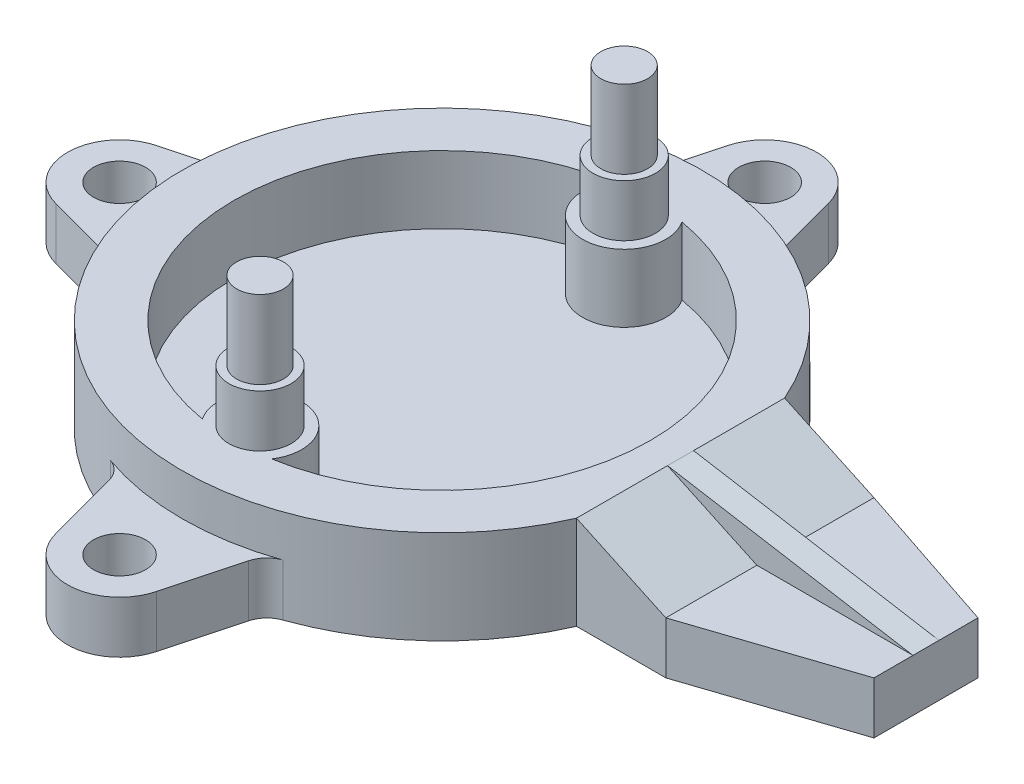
ISO-10303-21;
HEADER;
FILE_DESCRIPTION(('STEP AP214'),'2;1');
FILE_NAME('part.step','',(''),(''),'','','');
FILE_SCHEMA(('AUTOMOTIVE_DESIGN { 1 0 10303 214 1 1 1 1 }'));
ENDSEC;
DATA;
#1=APPLICATION_CONTEXT('core data for automotive mechanical design processes');
#2=APPLICATION_PROTOCOL_DEFINITION('international standard','automotive_design',2000,#1);
#3=PRODUCT_CONTEXT('',#1,'mechanical');
#4=PRODUCT('Part','Part','',(#3));
#5=PRODUCT_RELATED_PRODUCT_CATEGORY('part','',(#4));
#6=PRODUCT_DEFINITION_FORMATION('','',#4);
#7=PRODUCT_DEFINITION_CONTEXT('part definition',#1,'design');
#8=PRODUCT_DEFINITION('design','',#6,#7);
#9=PRODUCT_DEFINITION_SHAPE('','',#8);
#10=(LENGTH_UNIT() NAMED_UNIT(*) SI_UNIT(.MILLI.,.METRE.));
#11=(NAMED_UNIT(*) PLANE_ANGLE_UNIT() SI_UNIT($,.RADIAN.));
#12=(NAMED_UNIT(*) SI_UNIT($,.STERADIAN.) SOLID_ANGLE_UNIT());
#13=UNCERTAINTY_MEASURE_WITH_UNIT(LENGTH_MEASURE(1.E-05),#10,'distance_accuracy_value','');
#14=(GEOMETRIC_REPRESENTATION_CONTEXT(3) GLOBAL_UNCERTAINTY_ASSIGNED_CONTEXT((#13)) GLOBAL_UNIT_ASSIGNED_CONTEXT((#10,
#11,#12)) REPRESENTATION_CONTEXT('',''));
#15=CARTESIAN_POINT('',(0.,0.,0.));
#16=DIRECTION('',(0.,0.,1.));
#17=DIRECTION('',(1.,0.,0.));
#18=AXIS2_PLACEMENT_3D('',#15,#16,#17);
#19=CARTESIAN_POINT('',(0.,5.,0.));
#20=DIRECTION('',(0.,1.,0.));
#21=DIRECTION('',(0.,0.,1.));
#22=AXIS2_PLACEMENT_3D('',#19,#20,#21);
#23=CYLINDRICAL_SURFACE('',#22,40.);
#24=CARTESIAN_POINT('',(0.,5.,0.));
#25=DIRECTION('',(0.,1.,0.));
#26=DIRECTION('',(0.,0.,1.));
#27=AXIS2_PLACEMENT_3D('',#24,#25,#26);
#28=CIRCLE('',#27,40.);
#29=CARTESIAN_POINT('',(6.65289564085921,5.,39.4428571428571));
#30=VERTEX_POINT('',#29);
#31=CARTESIAN_POINT('',(6.65289564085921,5.,-39.4428571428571));
#32=VERTEX_POINT('',#31);
#33=EDGE_CURVE('E447',#30,#32,#28,.T.);
#34=ORIENTED_EDGE('',*,*,#33,.F.);
#35=DIRECTION('',(0.,1.,0.));
#36=VECTOR('',#35,1.);
#37=CARTESIAN_POINT('',(6.6528956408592,11.5,39.4428571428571));
#38=LINE('',#37,#36);
#39=CARTESIAN_POINT('',(6.6528956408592,18.,39.4428571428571));
#40=VERTEX_POINT('',#39);
#41=EDGE_CURVE('E363',#40,#30,#38,.F.);
#42=ORIENTED_EDGE('',*,*,#41,.F.);
#43=CARTESIAN_POINT('',(0.,18.,0.));
#44=DIRECTION('',(0.,1.,0.));
#45=DIRECTION('',(0.,0.,1.));
#46=AXIS2_PLACEMENT_3D('',#43,#44,#45);
#47=CIRCLE('',#46,40.);
#48=CARTESIAN_POINT('',(6.6528956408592,18.,-39.4428571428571));
#49=VERTEX_POINT('',#48);
#50=EDGE_CURVE('E443',#40,#49,#47,.T.);
#51=ORIENTED_EDGE('',*,*,#50,.T.);
#52=DIRECTION('',(0.,1.,0.));
#53=VECTOR('',#52,1.);
#54=CARTESIAN_POINT('',(6.6528956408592,11.5,-39.4428571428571));
#55=LINE('',#54,#53);
#56=EDGE_CURVE('E378',#32,#49,#55,.T.);
#57=ORIENTED_EDGE('',*,*,#56,.F.);
#58=EDGE_LOOP('',(#34,#42,#51,#57));
#59=FACE_BOUND('',#58,.T.);
#60=ADVANCED_FACE('F34',(#59),#23,.F.);
#61=CARTESIAN_POINT('',(63.,10.,-50.));
#62=DIRECTION('',(0.,-1.,0.));
#63=DIRECTION('',(0.,0.,-1.));
#64=AXIS2_PLACEMENT_3D('',#61,#62,#63);
#65=PLANE('',#64);
#66=DIRECTION('',(-1.,0.,0.));
#67=VECTOR('',#66,1.);
#68=CARTESIAN_POINT('',(63.,10.,-2.5));
#69=LINE('',#68,#67);
#70=CARTESIAN_POINT('',(93.,10.,-2.5));
#71=VERTEX_POINT('',#70);
#72=CARTESIAN_POINT('',(63.,10.,-2.5));
#73=VERTEX_POINT('',#72);
#74=EDGE_CURVE('E386',#71,#73,#69,.T.);
#75=ORIENTED_EDGE('',*,*,#74,.F.);
#76=DIRECTION('',(0.,0.,1.));
#77=VECTOR('',#76,1.);
#78=CARTESIAN_POINT('',(93.,10.,-50.));
#79=LINE('',#78,#77);
#80=CARTESIAN_POINT('',(93.,10.,-10.));
#81=VERTEX_POINT('',#80);
#82=EDGE_CURVE('E397',#81,#71,#79,.T.);
#83=ORIENTED_EDGE('',*,*,#82,.F.);
#84=DIRECTION('',(-0.948683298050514,0.,-0.316227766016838));
#85=VECTOR('',#84,1.);
#86=CARTESIAN_POINT('',(63.,9.99999999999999,-20.));
#87=LINE('',#86,#85);
#88=CARTESIAN_POINT('',(63.,10.,-20.));
#89=VERTEX_POINT('',#88);
#90=EDGE_CURVE('E411',#81,#89,#87,.T.);
#91=ORIENTED_EDGE('',*,*,#90,.T.);
#92=DIRECTION('',(0.,0.,1.));
#93=VECTOR('',#92,1.);
#94=CARTESIAN_POINT('',(63.,10.,-50.));
#95=LINE('',#94,#93);
#96=EDGE_CURVE('E402',#89,#73,#95,.T.);
#97=ORIENTED_EDGE('',*,*,#96,.T.);
#98=EDGE_LOOP('',(#75,#83,#91,#97));
#99=FACE_BOUND('',#98,.T.);
#100=ADVANCED_FACE('F537',(#99),#65,.F.);
#101=CARTESIAN_POINT('',(45.8257569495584,18.,-50.));
#102=DIRECTION('',(-0.42225053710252,-0.906479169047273,0.));
#103=DIRECTION('',(0.906479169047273,-0.42225053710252,0.));
#104=AXIS2_PLACEMENT_3D('',#101,#102,#103);
#105=PLANE('',#104);
#106=DIRECTION('',(-0.906479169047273,0.42225053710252,0.));
#107=VECTOR('',#106,1.);
#108=CARTESIAN_POINT('',(45.8257569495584,18.,-2.5));
#109=LINE('',#108,#107);
#110=CARTESIAN_POINT('',(45.8257569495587,17.9999999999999,-2.5));
#111=VERTEX_POINT('',#110);
#112=EDGE_CURVE('E462',#73,#111,#109,.T.);
#113=ORIENTED_EDGE('',*,*,#112,.F.);
#114=ORIENTED_EDGE('',*,*,#96,.F.);
#115=DIRECTION('',(-0.906479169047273,0.42225053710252,0.));
#116=VECTOR('',#115,1.);
#117=CARTESIAN_POINT('',(76.3892069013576,3.76312220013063,-20.));
#118=LINE('',#117,#116);
#119=CARTESIAN_POINT('',(45.8257569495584,18.,-20.));
#120=VERTEX_POINT('',#119);
#121=EDGE_CURVE('E452',#89,#120,#118,.T.);
#122=ORIENTED_EDGE('',*,*,#121,.T.);
#123=DIRECTION('',(0.,0.,1.));
#124=VECTOR('',#123,1.);
#125=CARTESIAN_POINT('',(45.8257569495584,18.,-50.));
#126=LINE('',#125,#124);
#127=EDGE_CURVE('E406',#120,#111,#126,.T.);
#128=ORIENTED_EDGE('',*,*,#127,.T.);
#129=EDGE_LOOP('',(#113,#114,#122,#128));
#130=FACE_BOUND('',#129,.T.);
#131=ADVANCED_FACE('F544',(#130),#105,.F.);
#132=CARTESIAN_POINT('',(0.,18.,0.));
#133=DIRECTION('',(0.,-1.,0.));
#134=DIRECTION('',(0.,0.,-1.));
#135=AXIS2_PLACEMENT_3D('',#132,#133,#134);
#136=CYLINDRICAL_SURFACE('',#135,50.);
#137=CARTESIAN_POINT('',(0.,0.,0.));
#138=DIRECTION('',(0.,1.,0.));
#139=DIRECTION('',(0.,0.,1.));
#140=AXIS2_PLACEMENT_3D('',#137,#138,#139);
#141=CIRCLE('',#140,50.);
#142=CARTESIAN_POINT('',(45.8257569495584,0.,-20.));
#143=VERTEX_POINT('',#142);
#144=CARTESIAN_POINT('',(16.5806192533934,0.,-47.1707861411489));
#145=VERTEX_POINT('',#144);
#146=EDGE_CURVE('E453',#143,#145,#141,.T.);
#147=ORIENTED_EDGE('',*,*,#146,.T.);
#148=DIRECTION('',(0.,-1.,0.));
#149=VECTOR('',#148,1.);
#150=CARTESIAN_POINT('',(16.5806192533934,18.,-47.1707861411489));
#151=LINE('',#150,#149);
#152=CARTESIAN_POINT('',(16.5806192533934,10.,-47.1707861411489));
#153=VERTEX_POINT('',#152);
#154=EDGE_CURVE('E483',#145,#153,#151,.F.);
#155=ORIENTED_EDGE('',*,*,#154,.T.);
#156=CARTESIAN_POINT('',(0.,10.,0.));
#157=DIRECTION('',(0.,1.,0.));
#158=DIRECTION('',(1.,0.,0.));
#159=AXIS2_PLACEMENT_3D('',#156,#157,#158);
#160=CIRCLE('',#159,50.);
#161=CARTESIAN_POINT('',(-16.5806192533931,10.,-47.170786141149));
#162=VERTEX_POINT('',#161);
#163=EDGE_CURVE('E290',#153,#162,#160,.T.);
#164=ORIENTED_EDGE('',*,*,#163,.T.);
#165=DIRECTION('',(0.,-1.,0.));
#166=VECTOR('',#165,1.);
#167=CARTESIAN_POINT('',(-16.5806192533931,18.,-47.170786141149));
#168=LINE('',#167,#166);
#169=CARTESIAN_POINT('',(-16.5806192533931,0.,-47.170786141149));
#170=VERTEX_POINT('',#169);
#171=EDGE_CURVE('E480',#162,#170,#168,.T.);
#172=ORIENTED_EDGE('',*,*,#171,.T.);
#173=CARTESIAN_POINT('',(-47.1707861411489,0.,-16.5806192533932));
#174=VERTEX_POINT('',#173);
#175=EDGE_CURVE('E456',#170,#174,#141,.T.);
#176=ORIENTED_EDGE('',*,*,#175,.T.);
#177=DIRECTION('',(0.,-1.,0.));
#178=VECTOR('',#177,1.);
#179=CARTESIAN_POINT('',(-47.1707861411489,18.,-16.5806192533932));
#180=LINE('',#179,#178);
#181=CARTESIAN_POINT('',(-47.1707861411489,10.,-16.5806192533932));
#182=VERTEX_POINT('',#181);
#183=EDGE_CURVE('E477',#174,#182,#180,.F.);
#184=ORIENTED_EDGE('',*,*,#183,.T.);
#185=CARTESIAN_POINT('',(0.,10.,0.));
#186=DIRECTION('',(0.,1.,0.));
#187=DIRECTION('',(0.,0.,-1.));
#188=AXIS2_PLACEMENT_3D('',#185,#186,#187);
#189=CIRCLE('',#188,50.);
#190=CARTESIAN_POINT('',(-47.1707861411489,10.,16.5806192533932));
#191=VERTEX_POINT('',#190);
#192=EDGE_CURVE('E319',#182,#191,#189,.T.);
#193=ORIENTED_EDGE('',*,*,#192,.T.);
#194=DIRECTION('',(0.,-1.,0.));
#195=VECTOR('',#194,1.);
#196=CARTESIAN_POINT('',(-47.1707861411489,18.,16.5806192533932));
#197=LINE('',#196,#195);
#198=CARTESIAN_POINT('',(-47.1707861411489,0.,16.5806192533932));
#199=VERTEX_POINT('',#198);
#200=EDGE_CURVE('E474',#191,#199,#197,.T.);
#201=ORIENTED_EDGE('',*,*,#200,.T.);
#202=CARTESIAN_POINT('',(-16.5806192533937,0.,47.1707861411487));
#203=VERTEX_POINT('',#202);
#204=EDGE_CURVE('E457',#199,#203,#141,.T.);
#205=ORIENTED_EDGE('',*,*,#204,.T.);
#206=DIRECTION('',(0.,-1.,0.));
#207=VECTOR('',#206,1.);
#208=CARTESIAN_POINT('',(-16.5806192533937,18.,47.1707861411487));
#209=LINE('',#208,#207);
#210=CARTESIAN_POINT('',(-16.5806192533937,10.,47.1707861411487));
#211=VERTEX_POINT('',#210);
#212=EDGE_CURVE('E471',#203,#211,#209,.F.);
#213=ORIENTED_EDGE('',*,*,#212,.T.);
#214=CARTESIAN_POINT('',(0.,10.,0.));
#215=DIRECTION('',(0.,1.,0.));
#216=DIRECTION('',(-1.,0.,0.));
#217=AXIS2_PLACEMENT_3D('',#214,#215,#216);
#218=CIRCLE('',#217,50.);
#219=CARTESIAN_POINT('',(16.5806192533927,10.,47.1707861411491));
#220=VERTEX_POINT('',#219);
#221=EDGE_CURVE('E257',#211,#220,#218,.T.);
#222=ORIENTED_EDGE('',*,*,#221,.T.);
#223=DIRECTION('',(0.,-1.,0.));
#224=VECTOR('',#223,1.);
#225=CARTESIAN_POINT('',(16.5806192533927,18.,47.1707861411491));
#226=LINE('',#225,#224);
#227=CARTESIAN_POINT('',(16.5806192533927,0.,47.1707861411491));
#228=VERTEX_POINT('',#227);
#229=EDGE_CURVE('E468',#220,#228,#226,.T.);
#230=ORIENTED_EDGE('',*,*,#229,.T.);
#231=CARTESIAN_POINT('',(45.8257569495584,0.,20.));
#232=VERTEX_POINT('',#231);
#233=EDGE_CURVE('E446',#228,#232,#141,.T.);
#234=ORIENTED_EDGE('',*,*,#233,.T.);
#235=DIRECTION('',(0.,1.,0.));
#236=VECTOR('',#235,1.);
#237=CARTESIAN_POINT('',(45.8257569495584,-61.8498925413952,20.));
#238=LINE('',#237,#236);
#239=CARTESIAN_POINT('',(45.8257569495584,18.,20.));
#240=VERTEX_POINT('',#239);
#241=EDGE_CURVE('E434',#232,#240,#238,.T.);
#242=ORIENTED_EDGE('',*,*,#241,.T.);
#243=CARTESIAN_POINT('',(0.,18.,0.));
#244=DIRECTION('',(0.,1.,0.));
#245=DIRECTION('',(0.,0.,1.));
#246=AXIS2_PLACEMENT_3D('',#243,#244,#245);
#247=CIRCLE('',#246,50.);
#248=EDGE_CURVE('E450',#120,#240,#247,.T.);
#249=ORIENTED_EDGE('',*,*,#248,.F.);
#250=DIRECTION('',(0.,1.,0.));
#251=VECTOR('',#250,1.);
#252=CARTESIAN_POINT('',(45.8257569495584,-61.8498925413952,-20.));
#253=LINE('',#252,#251);
#254=EDGE_CURVE('E437',#143,#120,#253,.T.);
#255=ORIENTED_EDGE('',*,*,#254,.F.);
#256=EDGE_LOOP('',(#147,#155,#164,#172,#176,#184,#193,#201,#205,#213,#222,#230,#234,#242,#249,#255));
#257=FACE_BOUND('',#256,.T.);
#258=ADVANCED_FACE('F523',(#257),#136,.T.);
#259=CARTESIAN_POINT('',(0.,18.,0.));
#260=DIRECTION('',(0.,1.,0.));
#261=DIRECTION('',(0.,0.,1.));
#262=AXIS2_PLACEMENT_3D('',#259,#260,#261);
#263=PLANE('',#262);
#264=CARTESIAN_POINT('',(0.,18.,35.));
#265=DIRECTION('',(0.,1.,0.));
#266=DIRECTION('',(0.,0.,1.));
#267=AXIS2_PLACEMENT_3D('',#264,#265,#266);
#268=CIRCLE('',#267,6.);
#269=CARTESIAN_POINT('',(0.,18.,41.));
#270=VERTEX_POINT('',#269);
#271=EDGE_CURVE('E345',#270,#270,#268,.T.);
#272=ORIENTED_EDGE('',*,*,#271,.F.);
#273=EDGE_LOOP('',(#272));
#274=FACE_BOUND('',#273,.T.);
#275=CARTESIAN_POINT('',(0.,18.,-35.));
#276=DIRECTION('',(0.,1.,0.));
#277=DIRECTION('',(0.,0.,1.));
#278=AXIS2_PLACEMENT_3D('',#275,#276,#277);
#279=CIRCLE('',#278,6.);
#280=CARTESIAN_POINT('',(0.,18.,-29.));
#281=VERTEX_POINT('',#280);
#282=EDGE_CURVE('E352',#281,#281,#279,.T.);
#283=ORIENTED_EDGE('',*,*,#282,.F.);
#284=EDGE_LOOP('',(#283));
#285=FACE_BOUND('',#284,.T.);
#286=CARTESIAN_POINT('',(-6.6528956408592,18.,-39.4428571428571));
#287=VERTEX_POINT('',#286);
#288=CARTESIAN_POINT('',(-6.6528956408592,18.,39.4428571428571));
#289=VERTEX_POINT('',#288);
#290=EDGE_CURVE('E448',#287,#289,#47,.T.);
#291=ORIENTED_EDGE('',*,*,#290,.F.);
#292=CARTESIAN_POINT('',(0.,18.,-35.));
#293=DIRECTION('',(0.,1.,0.));
#294=DIRECTION('',(0.,0.,1.));
#295=AXIS2_PLACEMENT_3D('',#292,#293,#294);
#296=CIRCLE('',#295,8.);
#297=EDGE_CURVE('E366',#287,#49,#296,.T.);
#298=ORIENTED_EDGE('',*,*,#297,.T.);
#299=ORIENTED_EDGE('',*,*,#50,.F.);
#300=CARTESIAN_POINT('',(0.,18.,35.));
#301=DIRECTION('',(0.,1.,0.));
#302=DIRECTION('',(0.,0.,1.));
#303=AXIS2_PLACEMENT_3D('',#300,#301,#302);
#304=CIRCLE('',#303,8.);
#305=EDGE_CURVE('E358',#40,#289,#304,.T.);
#306=ORIENTED_EDGE('',*,*,#305,.T.);
#307=EDGE_LOOP('',(#291,#298,#299,#306));
#308=FACE_BOUND('',#307,.T.);
#309=ORIENTED_EDGE('',*,*,#248,.T.);
#310=CARTESIAN_POINT('',(45.8257569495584,18.,2.5));
#311=VERTEX_POINT('',#310);
#312=EDGE_CURVE('E396',#311,#240,#126,.T.);
#313=ORIENTED_EDGE('',*,*,#312,.F.);
#314=EDGE_CURVE('E408',#111,#311,#126,.T.);
#315=ORIENTED_EDGE('',*,*,#314,.F.);
#316=ORIENTED_EDGE('',*,*,#127,.F.);
#317=EDGE_LOOP('',(#309,#313,#315,#316));
#318=FACE_BOUND('',#317,.T.);
#319=ADVANCED_FACE('F560',(#274,#285,#308,#318),#263,.T.);
#320=CARTESIAN_POINT('',(0.,0.,0.));
#321=DIRECTION('',(0.,1.,0.));
#322=DIRECTION('',(0.,0.,1.));
#323=AXIS2_PLACEMENT_3D('',#320,#321,#322);
#324=PLANE('',#323);
#325=DIRECTION('',(-1.,0.,0.));
#326=VECTOR('',#325,1.);
#327=CARTESIAN_POINT('',(63.,0.,20.));
#328=LINE('',#327,#326);
#329=CARTESIAN_POINT('',(63.,0.,20.));
#330=VERTEX_POINT('',#329);
#331=EDGE_CURVE('E415',#330,#232,#328,.T.);
#332=ORIENTED_EDGE('',*,*,#331,.T.);
#333=ORIENTED_EDGE('',*,*,#233,.F.);
#334=CARTESIAN_POINT('',(18.238681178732,0.,51.887864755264));
#335=DIRECTION('',(0.,1.,0.));
#336=DIRECTION('',(0.,0.,1.));
#337=AXIS2_PLACEMENT_3D('',#334,#335,#336);
#338=CIRCLE('',#337,5.);
#339=CARTESIAN_POINT('',(13.4090520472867,0.,50.5937695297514));
#340=VERTEX_POINT('',#339);
#341=EDGE_CURVE('E42',#228,#340,#338,.T.);
#342=ORIENTED_EDGE('',*,*,#341,.T.);
#343=DIRECTION('',(-0.258819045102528,0.,0.965925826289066));
#344=VECTOR('',#343,1.);
#345=CARTESIAN_POINT('',(14.1129135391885,0.,47.9669226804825));
#346=LINE('',#345,#344);
#347=CARTESIAN_POINT('',(9.65925826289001,0.,64.5881904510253));
#348=VERTEX_POINT('',#347);
#349=EDGE_CURVE('E262',#340,#348,#346,.T.);
#350=ORIENTED_EDGE('',*,*,#349,.T.);
#351=CARTESIAN_POINT('',(-6.57008339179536E-13,0.,62.));
#352=DIRECTION('',(0.,-1.,0.));
#353=DIRECTION('',(-1.,0.,0.));
#354=AXIS2_PLACEMENT_3D('',#351,#352,#353);
#355=CIRCLE('',#354,10.);
#356=CARTESIAN_POINT('',(-9.65925826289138,0.,64.5881904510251));
#357=VERTEX_POINT('',#356);
#358=EDGE_CURVE('E271',#348,#357,#355,.T.);
#359=ORIENTED_EDGE('',*,*,#358,.T.);
#360=DIRECTION('',(-0.258819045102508,0.,-0.965925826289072));
#361=VECTOR('',#360,1.);
#362=CARTESIAN_POINT('',(-9.65925826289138,0.,64.5881904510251));
#363=LINE('',#362,#361);
#364=CARTESIAN_POINT('',(-13.4090520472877,0.,50.5937695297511));
#365=VERTEX_POINT('',#364);
#366=EDGE_CURVE('E243',#357,#365,#363,.T.);
#367=ORIENTED_EDGE('',*,*,#366,.T.);
#368=CARTESIAN_POINT('',(-18.2386811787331,0.,51.8878647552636));
#369=DIRECTION('',(0.,1.,0.));
#370=DIRECTION('',(0.,0.,1.));
#371=AXIS2_PLACEMENT_3D('',#368,#369,#370);
#372=CIRCLE('',#371,5.);
#373=EDGE_CURVE('E514',#365,#203,#372,.T.);
#374=ORIENTED_EDGE('',*,*,#373,.T.);
#375=ORIENTED_EDGE('',*,*,#204,.F.);
#376=CARTESIAN_POINT('',(-51.8878647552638,0.,18.2386811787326));
#377=DIRECTION('',(0.,1.,0.));
#378=DIRECTION('',(0.,0.,1.));
#379=AXIS2_PLACEMENT_3D('',#376,#377,#378);
#380=CIRCLE('',#379,5.);
#381=CARTESIAN_POINT('',(-50.5937695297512,0.,13.4090520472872));
#382=VERTEX_POINT('',#381);
#383=EDGE_CURVE('E509',#199,#382,#380,.T.);
#384=ORIENTED_EDGE('',*,*,#383,.T.);
#385=DIRECTION('',(-0.965925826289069,0.,-0.258819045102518));
#386=VECTOR('',#385,1.);
#387=CARTESIAN_POINT('',(-47.9669226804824,0.,14.112913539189));
#388=LINE('',#387,#386);
#389=CARTESIAN_POINT('',(-64.5881904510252,0.,9.65925826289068));
#390=VERTEX_POINT('',#389);
#391=EDGE_CURVE('E316',#382,#390,#388,.T.);
#392=ORIENTED_EDGE('',*,*,#391,.T.);
#393=CARTESIAN_POINT('',(-62.,0.,0.));
#394=DIRECTION('',(0.,-1.,0.));
#395=DIRECTION('',(0.,0.,-1.));
#396=AXIS2_PLACEMENT_3D('',#393,#394,#395);
#397=CIRCLE('',#396,10.);
#398=CARTESIAN_POINT('',(-64.5881904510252,0.,-9.6592582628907));
#399=VERTEX_POINT('',#398);
#400=EDGE_CURVE('E309',#390,#399,#397,.T.);
#401=ORIENTED_EDGE('',*,*,#400,.T.);
#402=DIRECTION('',(0.965925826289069,0.,-0.258819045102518));
#403=VECTOR('',#402,1.);
#404=CARTESIAN_POINT('',(-64.5881904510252,0.,-9.6592582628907));
#405=LINE('',#404,#403);
#406=CARTESIAN_POINT('',(-50.5937695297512,0.,-13.4090520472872));
#407=VERTEX_POINT('',#406);
#408=EDGE_CURVE('E326',#399,#407,#405,.T.);
#409=ORIENTED_EDGE('',*,*,#408,.T.);
#410=CARTESIAN_POINT('',(-51.8878647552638,0.,-18.2386811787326));
#411=DIRECTION('',(0.,1.,0.));
#412=DIRECTION('',(0.,0.,1.));
#413=AXIS2_PLACEMENT_3D('',#410,#411,#412);
#414=CIRCLE('',#413,5.);
#415=EDGE_CURVE('E505',#407,#174,#414,.T.);
#416=ORIENTED_EDGE('',*,*,#415,.T.);
#417=ORIENTED_EDGE('',*,*,#175,.F.);
#418=CARTESIAN_POINT('',(-18.2386811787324,0.,-51.8878647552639));
#419=DIRECTION('',(0.,1.,0.));
#420=DIRECTION('',(0.,0.,1.));
#421=AXIS2_PLACEMENT_3D('',#418,#419,#420);
#422=CIRCLE('',#421,5.);
#423=CARTESIAN_POINT('',(-13.409052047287,0.,-50.5937695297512));
#424=VERTEX_POINT('',#423);
#425=EDGE_CURVE('E500',#170,#424,#422,.T.);
#426=ORIENTED_EDGE('',*,*,#425,.T.);
#427=DIRECTION('',(0.258819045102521,0.,-0.965925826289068));
#428=VECTOR('',#427,1.);
#429=CARTESIAN_POINT('',(-14.1129135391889,0.,-47.9669226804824));
#430=LINE('',#429,#428);
#431=CARTESIAN_POINT('',(-9.65925826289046,0.,-64.5881904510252));
#432=VERTEX_POINT('',#431);
#433=EDGE_CURVE('E287',#424,#432,#430,.T.);
#434=ORIENTED_EDGE('',*,*,#433,.T.);
#435=CARTESIAN_POINT('',(2.24064653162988E-13,0.,-62.));
#436=DIRECTION('',(0.,-1.,0.));
#437=DIRECTION('',(1.,0.,0.));
#438=AXIS2_PLACEMENT_3D('',#435,#436,#437);
#439=CIRCLE('',#438,10.);
#440=CARTESIAN_POINT('',(9.65925826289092,0.,-64.5881904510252));
#441=VERTEX_POINT('',#440);
#442=EDGE_CURVE('E280',#432,#441,#439,.T.);
#443=ORIENTED_EDGE('',*,*,#442,.T.);
#444=DIRECTION('',(0.258819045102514,0.,0.96592582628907));
#445=VECTOR('',#444,1.);
#446=CARTESIAN_POINT('',(9.65925826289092,0.,-64.5881904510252));
#447=LINE('',#446,#445);
#448=CARTESIAN_POINT('',(13.4090520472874,0.,-50.5937695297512));
#449=VERTEX_POINT('',#448);
#450=EDGE_CURVE('E297',#441,#449,#447,.T.);
#451=ORIENTED_EDGE('',*,*,#450,.T.);
#452=CARTESIAN_POINT('',(18.2386811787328,0.,-51.8878647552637));
#453=DIRECTION('',(0.,1.,0.));
#454=DIRECTION('',(0.,0.,1.));
#455=AXIS2_PLACEMENT_3D('',#452,#453,#454);
#456=CIRCLE('',#455,5.);
#457=EDGE_CURVE('E496',#449,#145,#456,.T.);
#458=ORIENTED_EDGE('',*,*,#457,.T.);
#459=ORIENTED_EDGE('',*,*,#146,.F.);
#460=DIRECTION('',(1.,0.,0.));
#461=VECTOR('',#460,1.);
#462=CARTESIAN_POINT('',(45.8257569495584,0.,-20.));
#463=LINE('',#462,#461);
#464=CARTESIAN_POINT('',(63.,0.,-20.));
#465=VERTEX_POINT('',#464);
#466=EDGE_CURVE('E425',#143,#465,#463,.T.);
#467=ORIENTED_EDGE('',*,*,#466,.T.);
#468=DIRECTION('',(0.948683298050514,0.,0.316227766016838));
#469=VECTOR('',#468,1.);
#470=CARTESIAN_POINT('',(63.,0.,-20.));
#471=LINE('',#470,#469);
#472=CARTESIAN_POINT('',(93.,0.,-10.));
#473=VERTEX_POINT('',#472);
#474=EDGE_CURVE('E423',#465,#473,#471,.T.);
#475=ORIENTED_EDGE('',*,*,#474,.T.);
#476=DIRECTION('',(0.,0.,1.));
#477=VECTOR('',#476,1.);
#478=CARTESIAN_POINT('',(93.,0.,-10.));
#479=LINE('',#478,#477);
#480=CARTESIAN_POINT('',(93.,0.,10.));
#481=VERTEX_POINT('',#480);
#482=EDGE_CURVE('E421',#473,#481,#479,.T.);
#483=ORIENTED_EDGE('',*,*,#482,.T.);
#484=DIRECTION('',(-0.948683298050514,0.,0.316227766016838));
#485=VECTOR('',#484,1.);
#486=CARTESIAN_POINT('',(93.,0.,10.));
#487=LINE('',#486,#485);
#488=EDGE_CURVE('E418',#481,#330,#487,.T.);
#489=ORIENTED_EDGE('',*,*,#488,.T.);
#490=EDGE_LOOP('',(#332,#333,#342,#350,#359,#367,#374,#375,#384,#392,#401,#409,#416,#417,#426,
#434,#443,#451,#458,#459,#467,#475,#483,#489));
#491=FACE_BOUND('',#490,.T.);
#492=CARTESIAN_POINT('',(-62.,0.,0.));
#493=DIRECTION('',(0.,-1.,0.));
#494=DIRECTION('',(0.,0.,-1.));
#495=AXIS2_PLACEMENT_3D('',#492,#493,#494);
#496=CIRCLE('',#495,5.);
#497=CARTESIAN_POINT('',(-62.,0.,-5.00000000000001));
#498=VERTEX_POINT('',#497);
#499=EDGE_CURVE('E304',#498,#498,#496,.T.);
#500=ORIENTED_EDGE('',*,*,#499,.F.);
#501=EDGE_LOOP('',(#500));
#502=FACE_BOUND('',#501,.T.);
#503=CARTESIAN_POINT('',(2.24064653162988E-13,0.,-62.));
#504=DIRECTION('',(0.,-1.,0.));
#505=DIRECTION('',(1.,0.,0.));
#506=AXIS2_PLACEMENT_3D('',#503,#504,#505);
#507=CIRCLE('',#506,5.);
#508=CARTESIAN_POINT('',(5.00000000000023,0.,-62.));
#509=VERTEX_POINT('',#508);
#510=EDGE_CURVE('E275',#509,#509,#507,.T.);
#511=ORIENTED_EDGE('',*,*,#510,.F.);
#512=EDGE_LOOP('',(#511));
#513=FACE_BOUND('',#512,.T.);
#514=CARTESIAN_POINT('',(-6.57008339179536E-13,0.,62.));
#515=DIRECTION('',(0.,-1.,0.));
#516=DIRECTION('',(-1.,0.,0.));
#517=AXIS2_PLACEMENT_3D('',#514,#515,#516);
#518=CIRCLE('',#517,5.);
#519=CARTESIAN_POINT('',(-5.00000000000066,0.,61.9999999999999));
#520=VERTEX_POINT('',#519);
#521=EDGE_CURVE('E266',#520,#520,#518,.T.);
#522=ORIENTED_EDGE('',*,*,#521,.F.);
#523=EDGE_LOOP('',(#522));
#524=FACE_BOUND('',#523,.T.);
#525=ADVANCED_FACE('F518',(#491,#502,#513,#524),#324,.F.);
#526=ORIENTED_EDGE('',*,*,#290,.T.);
#527=DIRECTION('',(0.,1.,0.));
#528=VECTOR('',#527,1.);
#529=CARTESIAN_POINT('',(-6.6528956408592,11.5,39.4428571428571));
#530=LINE('',#529,#528);
#531=CARTESIAN_POINT('',(-6.65289564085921,5.,39.4428571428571));
#532=VERTEX_POINT('',#531);
#533=EDGE_CURVE('E367',#532,#289,#530,.T.);
#534=ORIENTED_EDGE('',*,*,#533,.F.);
#535=CARTESIAN_POINT('',(-6.65289564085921,5.,-39.4428571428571));
#536=VERTEX_POINT('',#535);
#537=EDGE_CURVE('E444',#536,#532,#28,.T.);
#538=ORIENTED_EDGE('',*,*,#537,.F.);
#539=DIRECTION('',(0.,1.,0.));
#540=VECTOR('',#539,1.);
#541=CARTESIAN_POINT('',(-6.6528956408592,11.5,-39.4428571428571));
#542=LINE('',#541,#540);
#543=EDGE_CURVE('E374',#287,#536,#542,.F.);
#544=ORIENTED_EDGE('',*,*,#543,.F.);
#545=EDGE_LOOP('',(#526,#534,#538,#544));
#546=FACE_BOUND('',#545,.T.);
#547=ADVANCED_FACE('F540',(#546),#23,.F.);
#548=CARTESIAN_POINT('',(0.,5.,0.));
#549=DIRECTION('',(0.,1.,0.));
#550=DIRECTION('',(0.,0.,1.));
#551=AXIS2_PLACEMENT_3D('',#548,#549,#550);
#552=PLANE('',#551);
#553=CARTESIAN_POINT('',(0.,5.,35.));
#554=DIRECTION('',(0.,1.,0.));
#555=DIRECTION('',(0.,0.,1.));
#556=AXIS2_PLACEMENT_3D('',#553,#554,#555);
#557=CIRCLE('',#556,8.);
#558=EDGE_CURVE('E364',#532,#30,#557,.F.);
#559=ORIENTED_EDGE('',*,*,#558,.T.);
#560=ORIENTED_EDGE('',*,*,#33,.T.);
#561=CARTESIAN_POINT('',(0.,5.,-35.));
#562=DIRECTION('',(0.,1.,0.));
#563=DIRECTION('',(0.,0.,1.));
#564=AXIS2_PLACEMENT_3D('',#561,#562,#563);
#565=CIRCLE('',#564,8.);
#566=EDGE_CURVE('E375',#32,#536,#565,.F.);
#567=ORIENTED_EDGE('',*,*,#566,.T.);
#568=ORIENTED_EDGE('',*,*,#537,.T.);
#569=EDGE_LOOP('',(#559,#560,#567,#568));
#570=FACE_BOUND('',#569,.T.);
#571=ADVANCED_FACE('F552',(#570),#552,.T.);
#572=CARTESIAN_POINT('',(63.,-61.8498925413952,-20.));
#573=DIRECTION('',(0.316227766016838,0.,-0.948683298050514));
#574=DIRECTION('',(-0.948683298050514,0.,-0.316227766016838));
#575=AXIS2_PLACEMENT_3D('',#572,#573,#574);
#576=PLANE('',#575);
#577=ORIENTED_EDGE('',*,*,#90,.F.);
#578=DIRECTION('',(0.,1.,0.));
#579=VECTOR('',#578,1.);
#580=CARTESIAN_POINT('',(93.,-61.8498925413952,-10.));
#581=LINE('',#580,#579);
#582=EDGE_CURVE('E419',#473,#81,#581,.T.);
#583=ORIENTED_EDGE('',*,*,#582,.F.);
#584=ORIENTED_EDGE('',*,*,#474,.F.);
#585=DIRECTION('',(0.,1.,0.));
#586=VECTOR('',#585,1.);
#587=CARTESIAN_POINT('',(63.,-61.8498925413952,-20.));
#588=LINE('',#587,#586);
#589=EDGE_CURVE('E414',#465,#89,#588,.T.);
#590=ORIENTED_EDGE('',*,*,#589,.T.);
#591=EDGE_LOOP('',(#577,#583,#584,#590));
#592=FACE_BOUND('',#591,.T.);
#593=ADVANCED_FACE('F558',(#592),#576,.T.);
#594=CARTESIAN_POINT('',(93.,-61.8498925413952,-10.));
#595=DIRECTION('',(1.,0.,0.));
#596=DIRECTION('',(0.,0.,-1.));
#597=AXIS2_PLACEMENT_3D('',#594,#595,#596);
#598=PLANE('',#597);
#599=DIRECTION('',(0.,1.,0.));
#600=VECTOR('',#599,1.);
#601=CARTESIAN_POINT('',(93.,-61.8498925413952,10.));
#602=LINE('',#601,#600);
#603=CARTESIAN_POINT('',(93.,10.,9.99999999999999));
#604=VERTEX_POINT('',#603);
#605=EDGE_CURVE('E428',#481,#604,#602,.T.);
#606=ORIENTED_EDGE('',*,*,#605,.F.);
#607=ORIENTED_EDGE('',*,*,#482,.F.);
#608=ORIENTED_EDGE('',*,*,#582,.T.);
#609=ORIENTED_EDGE('',*,*,#82,.T.);
#610=DIRECTION('',(0.,0.,1.));
#611=VECTOR('',#610,1.);
#612=CARTESIAN_POINT('',(93.,10.,-50.));
#613=LINE('',#612,#611);
#614=CARTESIAN_POINT('',(93.,10.,2.5));
#615=VERTEX_POINT('',#614);
#616=EDGE_CURVE('E393',#71,#615,#613,.T.);
#617=ORIENTED_EDGE('',*,*,#616,.T.);
#618=EDGE_CURVE('E401',#615,#604,#79,.T.);
#619=ORIENTED_EDGE('',*,*,#618,.T.);
#620=EDGE_LOOP('',(#606,#607,#608,#609,#617,#619));
#621=FACE_BOUND('',#620,.T.);
#622=ADVANCED_FACE('F605',(#621),#598,.T.);
#623=CARTESIAN_POINT('',(93.,-61.8498925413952,10.));
#624=DIRECTION('',(0.316227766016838,0.,0.948683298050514));
#625=DIRECTION('',(0.948683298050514,0.,-0.316227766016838));
#626=AXIS2_PLACEMENT_3D('',#623,#624,#625);
#627=PLANE('',#626);
#628=DIRECTION('',(0.948683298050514,0.,-0.316227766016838));
#629=VECTOR('',#628,1.);
#630=CARTESIAN_POINT('',(93.,9.99999999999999,10.));
#631=LINE('',#630,#629);
#632=CARTESIAN_POINT('',(63.,10.,20.));
#633=VERTEX_POINT('',#632);
#634=EDGE_CURVE('E459',#633,#604,#631,.T.);
#635=ORIENTED_EDGE('',*,*,#634,.F.);
#636=DIRECTION('',(0.,1.,0.));
#637=VECTOR('',#636,1.);
#638=CARTESIAN_POINT('',(63.,-61.8498925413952,20.));
#639=LINE('',#638,#637);
#640=EDGE_CURVE('E431',#330,#633,#639,.T.);
#641=ORIENTED_EDGE('',*,*,#640,.F.);
#642=ORIENTED_EDGE('',*,*,#488,.F.);
#643=ORIENTED_EDGE('',*,*,#605,.T.);
#644=EDGE_LOOP('',(#635,#641,#642,#643));
#645=FACE_BOUND('',#644,.T.);
#646=ADVANCED_FACE('F608',(#645),#627,.T.);
#647=CARTESIAN_POINT('',(63.,-61.8498925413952,20.));
#648=DIRECTION('',(0.,0.,1.));
#649=DIRECTION('',(1.,0.,0.));
#650=AXIS2_PLACEMENT_3D('',#647,#648,#649);
#651=PLANE('',#650);
#652=DIRECTION('',(0.906479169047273,-0.42225053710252,0.));
#653=VECTOR('',#652,1.);
#654=CARTESIAN_POINT('',(90.5013594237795,-2.81051367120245,20.));
#655=LINE('',#654,#653);
#656=EDGE_CURVE('E400',#240,#633,#655,.T.);
#657=ORIENTED_EDGE('',*,*,#656,.F.);
#658=ORIENTED_EDGE('',*,*,#241,.F.);
#659=ORIENTED_EDGE('',*,*,#331,.F.);
#660=ORIENTED_EDGE('',*,*,#640,.T.);
#661=EDGE_LOOP('',(#657,#658,#659,#660));
#662=FACE_BOUND('',#661,.T.);
#663=ADVANCED_FACE('F612',(#662),#651,.T.);
#664=CARTESIAN_POINT('',(45.8257569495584,-61.8498925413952,-20.));
#665=DIRECTION('',(0.,0.,-1.));
#666=DIRECTION('',(-1.,0.,0.));
#667=AXIS2_PLACEMENT_3D('',#664,#665,#666);
#668=PLANE('',#667);
#669=ORIENTED_EDGE('',*,*,#121,.F.);
#670=ORIENTED_EDGE('',*,*,#589,.F.);
#671=ORIENTED_EDGE('',*,*,#466,.F.);
#672=ORIENTED_EDGE('',*,*,#254,.T.);
#673=EDGE_LOOP('',(#669,#670,#671,#672));
#674=FACE_BOUND('',#673,.T.);
#675=ADVANCED_FACE('F600',(#674),#668,.T.);
#676=ORIENTED_EDGE('',*,*,#618,.F.);
#677=DIRECTION('',(-1.,0.,0.));
#678=VECTOR('',#677,1.);
#679=CARTESIAN_POINT('',(63.,10.,2.5));
#680=LINE('',#679,#678);
#681=CARTESIAN_POINT('',(63.,10.,2.5));
#682=VERTEX_POINT('',#681);
#683=EDGE_CURVE('E391',#615,#682,#680,.T.);
#684=ORIENTED_EDGE('',*,*,#683,.T.);
#685=EDGE_CURVE('E405',#682,#633,#95,.T.);
#686=ORIENTED_EDGE('',*,*,#685,.T.);
#687=ORIENTED_EDGE('',*,*,#634,.T.);
#688=EDGE_LOOP('',(#676,#684,#686,#687));
#689=FACE_BOUND('',#688,.T.);
#690=ADVANCED_FACE('F547',(#689),#65,.F.);
#691=ORIENTED_EDGE('',*,*,#685,.F.);
#692=DIRECTION('',(-0.906479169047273,0.42225053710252,0.));
#693=VECTOR('',#692,1.);
#694=CARTESIAN_POINT('',(45.8257569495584,18.,2.5));
#695=LINE('',#694,#693);
#696=EDGE_CURVE('E348',#682,#311,#695,.T.);
#697=ORIENTED_EDGE('',*,*,#696,.T.);
#698=ORIENTED_EDGE('',*,*,#312,.T.);
#699=ORIENTED_EDGE('',*,*,#656,.T.);
#700=EDGE_LOOP('',(#691,#697,#698,#699));
#701=FACE_BOUND('',#700,.T.);
#702=ADVANCED_FACE('F596',(#701),#105,.F.);
#703=CARTESIAN_POINT('',(93.,10.,0.));
#704=DIRECTION('',(0.167196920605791,0.985923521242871,0.));
#705=DIRECTION('',(-0.985923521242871,0.167196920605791,0.));
#706=AXIS2_PLACEMENT_3D('',#703,#704,#705);
#707=PLANE('',#706);
#708=ORIENTED_EDGE('',*,*,#616,.F.);
#709=DIRECTION('',(-0.985923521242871,0.167196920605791,0.));
#710=VECTOR('',#709,1.);
#711=CARTESIAN_POINT('',(93.,10.,-2.5));
#712=LINE('',#711,#710);
#713=EDGE_CURVE('E377',#71,#111,#712,.T.);
#714=ORIENTED_EDGE('',*,*,#713,.T.);
#715=ORIENTED_EDGE('',*,*,#314,.T.);
#716=DIRECTION('',(-0.985923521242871,0.167196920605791,0.));
#717=VECTOR('',#716,1.);
#718=CARTESIAN_POINT('',(93.,10.,2.5));
#719=LINE('',#718,#717);
#720=EDGE_CURVE('E383',#615,#311,#719,.T.);
#721=ORIENTED_EDGE('',*,*,#720,.F.);
#722=EDGE_LOOP('',(#708,#714,#715,#721));
#723=FACE_BOUND('',#722,.T.);
#724=ADVANCED_FACE('F592',(#723),#707,.T.);
#725=CARTESIAN_POINT('',(21.5,9.,2.5));
#726=DIRECTION('',(0.,0.,1.));
#727=DIRECTION('',(1.,0.,0.));
#728=AXIS2_PLACEMENT_3D('',#725,#726,#727);
#729=PLANE('',#728);
#730=ORIENTED_EDGE('',*,*,#696,.F.);
#731=ORIENTED_EDGE('',*,*,#683,.F.);
#732=ORIENTED_EDGE('',*,*,#720,.T.);
#733=EDGE_LOOP('',(#730,#731,#732));
#734=FACE_BOUND('',#733,.T.);
#735=ADVANCED_FACE('F586',(#734),#729,.T.);
#736=CARTESIAN_POINT('',(21.5,9.,-2.5));
#737=DIRECTION('',(0.,0.,1.));
#738=DIRECTION('',(1.,0.,0.));
#739=AXIS2_PLACEMENT_3D('',#736,#737,#738);
#740=PLANE('',#739);
#741=ORIENTED_EDGE('',*,*,#713,.F.);
#742=ORIENTED_EDGE('',*,*,#74,.T.);
#743=ORIENTED_EDGE('',*,*,#112,.T.);
#744=EDGE_LOOP('',(#741,#742,#743));
#745=FACE_BOUND('',#744,.T.);
#746=ADVANCED_FACE('F578',(#745),#740,.F.);
#747=CARTESIAN_POINT('',(0.,-0.00199999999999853,-35.));
#748=DIRECTION('',(0.,1.,0.));
#749=DIRECTION('',(0.,0.,1.));
#750=AXIS2_PLACEMENT_3D('',#747,#748,#749);
#751=CYLINDRICAL_SURFACE('',#750,8.);
#752=ORIENTED_EDGE('',*,*,#566,.F.);
#753=ORIENTED_EDGE('',*,*,#56,.T.);
#754=ORIENTED_EDGE('',*,*,#297,.F.);
#755=ORIENTED_EDGE('',*,*,#543,.T.);
#756=EDGE_LOOP('',(#752,#753,#754,#755));
#757=FACE_BOUND('',#756,.T.);
#758=ADVANCED_FACE('F576',(#757),#751,.T.);
#759=CARTESIAN_POINT('',(0.,-0.00199999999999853,35.));
#760=DIRECTION('',(0.,1.,0.));
#761=DIRECTION('',(0.,0.,1.));
#762=AXIS2_PLACEMENT_3D('',#759,#760,#761);
#763=CYLINDRICAL_SURFACE('',#762,8.);
#764=ORIENTED_EDGE('',*,*,#558,.F.);
#765=ORIENTED_EDGE('',*,*,#533,.T.);
#766=ORIENTED_EDGE('',*,*,#305,.F.);
#767=ORIENTED_EDGE('',*,*,#41,.T.);
#768=EDGE_LOOP('',(#764,#765,#766,#767));
#769=FACE_BOUND('',#768,.T.);
#770=ADVANCED_FACE('F570',(#769),#763,.T.);
#771=CARTESIAN_POINT('',(0.,28.,-35.));
#772=DIRECTION('',(0.,-1.,0.));
#773=DIRECTION('',(0.,0.,-1.));
#774=AXIS2_PLACEMENT_3D('',#771,#772,#773);
#775=CYLINDRICAL_SURFACE('',#774,6.);
#776=CARTESIAN_POINT('',(0.,28.,-35.));
#777=DIRECTION('',(0.,1.,0.));
#778=DIRECTION('',(0.,0.,1.));
#779=AXIS2_PLACEMENT_3D('',#776,#777,#778);
#780=CIRCLE('',#779,6.);
#781=CARTESIAN_POINT('',(0.,28.,-29.));
#782=VERTEX_POINT('',#781);
#783=EDGE_CURVE('E355',#782,#782,#780,.T.);
#784=ORIENTED_EDGE('',*,*,#783,.F.);
#785=EDGE_LOOP('',(#784));
#786=FACE_BOUND('',#785,.T.);
#787=ORIENTED_EDGE('',*,*,#282,.T.);
#788=EDGE_LOOP('',(#787));
#789=FACE_BOUND('',#788,.T.);
#790=ADVANCED_FACE('F584',(#786,#789),#775,.T.);
#791=CARTESIAN_POINT('',(0.,28.,-35.));
#792=DIRECTION('',(0.,1.,0.));
#793=DIRECTION('',(0.,0.,1.));
#794=AXIS2_PLACEMENT_3D('',#791,#792,#793);
#795=PLANE('',#794);
#796=CARTESIAN_POINT('',(0.,28.,-35.));
#797=DIRECTION('',(0.,1.,0.));
#798=DIRECTION('',(0.,0.,1.));
#799=AXIS2_PLACEMENT_3D('',#796,#797,#798);
#800=CIRCLE('',#799,4.5);
#801=CARTESIAN_POINT('',(0.,28.,-30.5));
#802=VERTEX_POINT('',#801);
#803=EDGE_CURVE('E342',#802,#802,#800,.T.);
#804=ORIENTED_EDGE('',*,*,#803,.F.);
#805=EDGE_LOOP('',(#804));
#806=FACE_BOUND('',#805,.T.);
#807=ORIENTED_EDGE('',*,*,#783,.T.);
#808=EDGE_LOOP('',(#807));
#809=FACE_BOUND('',#808,.T.);
#810=ADVANCED_FACE('F696',(#806,#809),#795,.T.);
#811=CARTESIAN_POINT('',(0.,28.,35.));
#812=DIRECTION('',(0.,-1.,0.));
#813=DIRECTION('',(0.,0.,-1.));
#814=AXIS2_PLACEMENT_3D('',#811,#812,#813);
#815=CYLINDRICAL_SURFACE('',#814,6.);
#816=CARTESIAN_POINT('',(0.,28.,35.));
#817=DIRECTION('',(0.,1.,0.));
#818=DIRECTION('',(0.,0.,1.));
#819=AXIS2_PLACEMENT_3D('',#816,#817,#818);
#820=CIRCLE('',#819,6.);
#821=CARTESIAN_POINT('',(0.,28.,41.));
#822=VERTEX_POINT('',#821);
#823=EDGE_CURVE('E349',#822,#822,#820,.T.);
#824=ORIENTED_EDGE('',*,*,#823,.F.);
#825=EDGE_LOOP('',(#824));
#826=FACE_BOUND('',#825,.T.);
#827=ORIENTED_EDGE('',*,*,#271,.T.);
#828=EDGE_LOOP('',(#827));
#829=FACE_BOUND('',#828,.T.);
#830=ADVANCED_FACE('F692',(#826,#829),#815,.T.);
#831=CARTESIAN_POINT('',(0.,28.,35.));
#832=DIRECTION('',(0.,1.,0.));
#833=DIRECTION('',(0.,0.,1.));
#834=AXIS2_PLACEMENT_3D('',#831,#832,#833);
#835=PLANE('',#834);
#836=CARTESIAN_POINT('',(0.,28.,35.));
#837=DIRECTION('',(0.,1.,0.));
#838=DIRECTION('',(0.,0.,1.));
#839=AXIS2_PLACEMENT_3D('',#836,#837,#838);
#840=CIRCLE('',#839,4.5);
#841=CARTESIAN_POINT('',(0.,28.,39.5));
#842=VERTEX_POINT('',#841);
#843=EDGE_CURVE('E338',#842,#842,#840,.T.);
#844=ORIENTED_EDGE('',*,*,#843,.F.);
#845=EDGE_LOOP('',(#844));
#846=FACE_BOUND('',#845,.T.);
#847=ORIENTED_EDGE('',*,*,#823,.T.);
#848=EDGE_LOOP('',(#847));
#849=FACE_BOUND('',#848,.T.);
#850=ADVANCED_FACE('F688',(#846,#849),#835,.T.);
#851=CARTESIAN_POINT('',(0.,43.,-35.));
#852=DIRECTION('',(0.,-1.,0.));
#853=DIRECTION('',(0.,0.,-1.));
#854=AXIS2_PLACEMENT_3D('',#851,#852,#853);
#855=CYLINDRICAL_SURFACE('',#854,4.5);
#856=CARTESIAN_POINT('',(0.,43.,-35.));
#857=DIRECTION('',(0.,1.,0.));
#858=DIRECTION('',(0.,0.,1.));
#859=AXIS2_PLACEMENT_3D('',#856,#857,#858);
#860=CIRCLE('',#859,4.5);
#861=CARTESIAN_POINT('',(0.,43.,-30.5));
#862=VERTEX_POINT('',#861);
#863=EDGE_CURVE('E337',#862,#862,#860,.T.);
#864=ORIENTED_EDGE('',*,*,#863,.F.);
#865=EDGE_LOOP('',(#864));
#866=FACE_BOUND('',#865,.T.);
#867=ORIENTED_EDGE('',*,*,#803,.T.);
#868=EDGE_LOOP('',(#867));
#869=FACE_BOUND('',#868,.T.);
#870=ADVANCED_FACE('F684',(#866,#869),#855,.T.);
#871=CARTESIAN_POINT('',(0.,43.,-35.));
#872=DIRECTION('',(0.,1.,0.));
#873=DIRECTION('',(0.,0.,1.));
#874=AXIS2_PLACEMENT_3D('',#871,#872,#873);
#875=PLANE('',#874);
#876=ORIENTED_EDGE('',*,*,#863,.T.);
#877=EDGE_LOOP('',(#876));
#878=FACE_BOUND('',#877,.T.);
#879=ADVANCED_FACE('F680',(#878),#875,.T.);
#880=CARTESIAN_POINT('',(0.,43.,35.));
#881=DIRECTION('',(0.,-1.,0.));
#882=DIRECTION('',(0.,0.,-1.));
#883=AXIS2_PLACEMENT_3D('',#880,#881,#882);
#884=CYLINDRICAL_SURFACE('',#883,4.5);
#885=CARTESIAN_POINT('',(0.,43.,35.));
#886=DIRECTION('',(0.,1.,0.));
#887=DIRECTION('',(0.,0.,1.));
#888=AXIS2_PLACEMENT_3D('',#885,#886,#887);
#889=CIRCLE('',#888,4.5);
#890=CARTESIAN_POINT('',(0.,43.,39.5));
#891=VERTEX_POINT('',#890);
#892=EDGE_CURVE('E333',#891,#891,#889,.T.);
#893=ORIENTED_EDGE('',*,*,#892,.F.);
#894=EDGE_LOOP('',(#893));
#895=FACE_BOUND('',#894,.T.);
#896=ORIENTED_EDGE('',*,*,#843,.T.);
#897=EDGE_LOOP('',(#896));
#898=FACE_BOUND('',#897,.T.);
#899=ADVANCED_FACE('F676',(#895,#898),#884,.T.);
#900=CARTESIAN_POINT('',(0.,43.,35.));
#901=DIRECTION('',(0.,1.,0.));
#902=DIRECTION('',(0.,0.,1.));
#903=AXIS2_PLACEMENT_3D('',#900,#901,#902);
#904=PLANE('',#903);
#905=ORIENTED_EDGE('',*,*,#892,.T.);
#906=EDGE_LOOP('',(#905));
#907=FACE_BOUND('',#906,.T.);
#908=ADVANCED_FACE('F669',(#907),#904,.T.);
#909=CARTESIAN_POINT('',(-62.,10.,0.));
#910=DIRECTION('',(0.,-1.,0.));
#911=DIRECTION('',(0.,0.,-1.));
#912=AXIS2_PLACEMENT_3D('',#909,#910,#911);
#913=CYLINDRICAL_SURFACE('',#912,10.);
#914=ORIENTED_EDGE('',*,*,#400,.F.);
#915=DIRECTION('',(0.,-1.,0.));
#916=VECTOR('',#915,1.);
#917=CARTESIAN_POINT('',(-64.5881904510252,10.,9.65925826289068));
#918=LINE('',#917,#916);
#919=CARTESIAN_POINT('',(-64.5881904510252,10.,9.65925826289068));
#920=VERTEX_POINT('',#919);
#921=EDGE_CURVE('E330',#920,#390,#918,.T.);
#922=ORIENTED_EDGE('',*,*,#921,.F.);
#923=CARTESIAN_POINT('',(-62.,10.,0.));
#924=DIRECTION('',(0.,-1.,0.));
#925=DIRECTION('',(0.,0.,-1.));
#926=AXIS2_PLACEMENT_3D('',#923,#924,#925);
#927=CIRCLE('',#926,10.);
#928=CARTESIAN_POINT('',(-64.5881904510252,10.,-9.6592582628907));
#929=VERTEX_POINT('',#928);
#930=EDGE_CURVE('E312',#920,#929,#927,.T.);
#931=ORIENTED_EDGE('',*,*,#930,.T.);
#932=DIRECTION('',(0.,-1.,0.));
#933=VECTOR('',#932,1.);
#934=CARTESIAN_POINT('',(-64.5881904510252,10.,-9.6592582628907));
#935=LINE('',#934,#933);
#936=EDGE_CURVE('E323',#929,#399,#935,.T.);
#937=ORIENTED_EDGE('',*,*,#936,.T.);
#938=EDGE_LOOP('',(#914,#922,#931,#937));
#939=FACE_BOUND('',#938,.T.);
#940=ADVANCED_FACE('F654',(#939),#913,.T.);
#941=CARTESIAN_POINT('',(-47.9669226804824,10.,14.112913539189));
#942=DIRECTION('',(-0.258819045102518,0.,0.965925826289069));
#943=DIRECTION('',(0.965925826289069,0.,0.258819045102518));
#944=AXIS2_PLACEMENT_3D('',#941,#942,#943);
#945=PLANE('',#944);
#946=ORIENTED_EDGE('',*,*,#391,.F.);
#947=DIRECTION('',(0.,-1.,0.));
#948=VECTOR('',#947,1.);
#949=CARTESIAN_POINT('',(-50.5937695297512,10.,13.4090520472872));
#950=LINE('',#949,#948);
#951=CARTESIAN_POINT('',(-50.5937695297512,10.,13.4090520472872));
#952=VERTEX_POINT('',#951);
#953=EDGE_CURVE('E491',#382,#952,#950,.F.);
#954=ORIENTED_EDGE('',*,*,#953,.T.);
#955=DIRECTION('',(-0.965925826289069,0.,-0.258819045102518));
#956=VECTOR('',#955,1.);
#957=CARTESIAN_POINT('',(-47.9669226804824,10.,14.112913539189));
#958=LINE('',#957,#956);
#959=EDGE_CURVE('E321',#952,#920,#958,.T.);
#960=ORIENTED_EDGE('',*,*,#959,.T.);
#961=ORIENTED_EDGE('',*,*,#921,.T.);
#962=EDGE_LOOP('',(#946,#954,#960,#961));
#963=FACE_BOUND('',#962,.T.);
#964=ADVANCED_FACE('F661',(#963),#945,.T.);
#965=CARTESIAN_POINT('',(-64.5881904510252,10.,-9.6592582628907));
#966=DIRECTION('',(-0.258819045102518,0.,-0.965925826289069));
#967=DIRECTION('',(-0.965925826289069,0.,0.258819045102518));
#968=AXIS2_PLACEMENT_3D('',#965,#966,#967);
#969=PLANE('',#968);
#970=DIRECTION('',(0.965925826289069,0.,-0.258819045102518));
#971=VECTOR('',#970,1.);
#972=CARTESIAN_POINT('',(-64.5881904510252,10.,-9.6592582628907));
#973=LINE('',#972,#971);
#974=CARTESIAN_POINT('',(-50.5937695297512,10.,-13.4090520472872));
#975=VERTEX_POINT('',#974);
#976=EDGE_CURVE('E315',#929,#975,#973,.T.);
#977=ORIENTED_EDGE('',*,*,#976,.T.);
#978=DIRECTION('',(0.,-1.,0.));
#979=VECTOR('',#978,1.);
#980=CARTESIAN_POINT('',(-50.5937695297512,10.,-13.4090520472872));
#981=LINE('',#980,#979);
#982=EDGE_CURVE('E488',#975,#407,#981,.T.);
#983=ORIENTED_EDGE('',*,*,#982,.T.);
#984=ORIENTED_EDGE('',*,*,#408,.F.);
#985=ORIENTED_EDGE('',*,*,#936,.F.);
#986=EDGE_LOOP('',(#977,#983,#984,#985));
#987=FACE_BOUND('',#986,.T.);
#988=ADVANCED_FACE('F650',(#987),#969,.T.);
#989=CARTESIAN_POINT('',(-62.,10.,0.));
#990=DIRECTION('',(0.,-1.,0.));
#991=DIRECTION('',(0.,0.,-1.));
#992=AXIS2_PLACEMENT_3D('',#989,#990,#991);
#993=PLANE('',#992);
#994=CARTESIAN_POINT('',(-62.,10.,0.));
#995=DIRECTION('',(0.,-1.,0.));
#996=DIRECTION('',(0.,0.,-1.));
#997=AXIS2_PLACEMENT_3D('',#994,#995,#996);
#998=CIRCLE('',#997,5.);
#999=CARTESIAN_POINT('',(-62.,10.,-5.00000000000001));
#1000=VERTEX_POINT('',#999);
#1001=EDGE_CURVE('E306',#1000,#1000,#998,.T.);
#1002=ORIENTED_EDGE('',*,*,#1001,.T.);
#1003=EDGE_LOOP('',(#1002));
#1004=FACE_BOUND('',#1003,.T.);
#1005=ORIENTED_EDGE('',*,*,#930,.F.);
#1006=ORIENTED_EDGE('',*,*,#959,.F.);
#1007=CARTESIAN_POINT('',(-51.8878647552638,10.,18.2386811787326));
#1008=DIRECTION('',(0.,-1.,0.));
#1009=DIRECTION('',(0.,0.,-1.));
#1010=AXIS2_PLACEMENT_3D('',#1007,#1008,#1009);
#1011=CIRCLE('',#1010,5.);
#1012=EDGE_CURVE('E511',#952,#191,#1011,.T.);
#1013=ORIENTED_EDGE('',*,*,#1012,.T.);
#1014=ORIENTED_EDGE('',*,*,#192,.F.);
#1015=CARTESIAN_POINT('',(-51.8878647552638,10.,-18.2386811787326));
#1016=DIRECTION('',(0.,-1.,0.));
#1017=DIRECTION('',(0.,0.,-1.));
#1018=AXIS2_PLACEMENT_3D('',#1015,#1016,#1017);
#1019=CIRCLE('',#1018,5.);
#1020=EDGE_CURVE('E507',#182,#975,#1019,.T.);
#1021=ORIENTED_EDGE('',*,*,#1020,.T.);
#1022=ORIENTED_EDGE('',*,*,#976,.F.);
#1023=EDGE_LOOP('',(#1005,#1006,#1013,#1014,#1021,#1022));
#1024=FACE_BOUND('',#1023,.T.);
#1025=ADVANCED_FACE('F648',(#1004,#1024),#993,.F.);
#1026=CARTESIAN_POINT('',(-62.,10.,0.));
#1027=DIRECTION('',(0.,-1.,0.));
#1028=DIRECTION('',(0.,0.,-1.));
#1029=AXIS2_PLACEMENT_3D('',#1026,#1027,#1028);
#1030=CYLINDRICAL_SURFACE('',#1029,5.);
#1031=ORIENTED_EDGE('',*,*,#1001,.F.);
#1032=EDGE_LOOP('',(#1031));
#1033=FACE_BOUND('',#1032,.T.);
#1034=ORIENTED_EDGE('',*,*,#499,.T.);
#1035=EDGE_LOOP('',(#1034));
#1036=FACE_BOUND('',#1035,.T.);
#1037=ADVANCED_FACE('F842',(#1033,#1036),#1030,.F.);
#1038=CARTESIAN_POINT('',(2.24064653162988E-13,10.,-62.));
#1039=DIRECTION('',(0.,-1.,0.));
#1040=DIRECTION('',(0.,0.,-1.));
#1041=AXIS2_PLACEMENT_3D('',#1038,#1039,#1040);
#1042=CYLINDRICAL_SURFACE('',#1041,10.);
#1043=ORIENTED_EDGE('',*,*,#442,.F.);
#1044=DIRECTION('',(0.,-1.,0.));
#1045=VECTOR('',#1044,1.);
#1046=CARTESIAN_POINT('',(-9.65925826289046,10.,-64.5881904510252));
#1047=LINE('',#1046,#1045);
#1048=CARTESIAN_POINT('',(-9.65925826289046,10.,-64.5881904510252));
#1049=VERTEX_POINT('',#1048);
#1050=EDGE_CURVE('E301',#1049,#432,#1047,.T.);
#1051=ORIENTED_EDGE('',*,*,#1050,.F.);
#1052=CARTESIAN_POINT('',(2.24064653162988E-13,10.,-62.));
#1053=DIRECTION('',(0.,-1.,0.));
#1054=DIRECTION('',(1.,0.,0.));
#1055=AXIS2_PLACEMENT_3D('',#1052,#1053,#1054);
#1056=CIRCLE('',#1055,10.);
#1057=CARTESIAN_POINT('',(9.65925826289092,10.,-64.5881904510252));
#1058=VERTEX_POINT('',#1057);
#1059=EDGE_CURVE('E283',#1049,#1058,#1056,.T.);
#1060=ORIENTED_EDGE('',*,*,#1059,.T.);
#1061=DIRECTION('',(0.,-1.,0.));
#1062=VECTOR('',#1061,1.);
#1063=CARTESIAN_POINT('',(9.65925826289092,10.,-64.5881904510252));
#1064=LINE('',#1063,#1062);
#1065=EDGE_CURVE('E294',#1058,#441,#1064,.T.);
#1066=ORIENTED_EDGE('',*,*,#1065,.T.);
#1067=EDGE_LOOP('',(#1043,#1051,#1060,#1066));
#1068=FACE_BOUND('',#1067,.T.);
#1069=ADVANCED_FACE('F833',(#1068),#1042,.T.);
#1070=CARTESIAN_POINT('',(-14.1129135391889,10.,-47.9669226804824));
#1071=DIRECTION('',(-0.965925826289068,0.,-0.258819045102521));
#1072=DIRECTION('',(-0.258819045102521,0.,0.965925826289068));
#1073=AXIS2_PLACEMENT_3D('',#1070,#1071,#1072);
#1074=PLANE('',#1073);
#1075=ORIENTED_EDGE('',*,*,#433,.F.);
#1076=DIRECTION('',(0.,-1.,0.));
#1077=VECTOR('',#1076,1.);
#1078=CARTESIAN_POINT('',(-13.409052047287,10.,-50.5937695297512));
#1079=LINE('',#1078,#1077);
#1080=CARTESIAN_POINT('',(-13.409052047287,10.,-50.5937695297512));
#1081=VERTEX_POINT('',#1080);
#1082=EDGE_CURVE('E486',#424,#1081,#1079,.F.);
#1083=ORIENTED_EDGE('',*,*,#1082,.T.);
#1084=DIRECTION('',(0.258819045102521,0.,-0.965925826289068));
#1085=VECTOR('',#1084,1.);
#1086=CARTESIAN_POINT('',(-14.1129135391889,10.,-47.9669226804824));
#1087=LINE('',#1086,#1085);
#1088=EDGE_CURVE('E292',#1081,#1049,#1087,.T.);
#1089=ORIENTED_EDGE('',*,*,#1088,.T.);
#1090=ORIENTED_EDGE('',*,*,#1050,.T.);
#1091=EDGE_LOOP('',(#1075,#1083,#1089,#1090));
#1092=FACE_BOUND('',#1091,.T.);
#1093=ADVANCED_FACE('F824',(#1092),#1074,.T.);
#1094=CARTESIAN_POINT('',(9.65925826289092,10.,-64.5881904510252));
#1095=DIRECTION('',(0.96592582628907,0.,-0.258819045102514));
#1096=DIRECTION('',(-0.258819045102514,0.,-0.96592582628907));
#1097=AXIS2_PLACEMENT_3D('',#1094,#1095,#1096);
#1098=PLANE('',#1097);
#1099=DIRECTION('',(0.258819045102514,0.,0.96592582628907));
#1100=VECTOR('',#1099,1.);
#1101=CARTESIAN_POINT('',(9.65925826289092,10.,-64.5881904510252));
#1102=LINE('',#1101,#1100);
#1103=CARTESIAN_POINT('',(13.4090520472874,10.,-50.5937695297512));
#1104=VERTEX_POINT('',#1103);
#1105=EDGE_CURVE('E286',#1058,#1104,#1102,.T.);
#1106=ORIENTED_EDGE('',*,*,#1105,.T.);
#1107=DIRECTION('',(0.,-1.,0.));
#1108=VECTOR('',#1107,1.);
#1109=CARTESIAN_POINT('',(13.4090520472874,10.,-50.5937695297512));
#1110=LINE('',#1109,#1108);
#1111=EDGE_CURVE('E341',#1104,#449,#1110,.T.);
#1112=ORIENTED_EDGE('',*,*,#1111,.T.);
#1113=ORIENTED_EDGE('',*,*,#450,.F.);
#1114=ORIENTED_EDGE('',*,*,#1065,.F.);
#1115=EDGE_LOOP('',(#1106,#1112,#1113,#1114));
#1116=FACE_BOUND('',#1115,.T.);
#1117=ADVANCED_FACE('F815',(#1116),#1098,.T.);
#1118=CARTESIAN_POINT('',(2.24064653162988E-13,10.,-62.));
#1119=DIRECTION('',(0.,-1.,0.));
#1120=DIRECTION('',(1.,0.,0.));
#1121=AXIS2_PLACEMENT_3D('',#1118,#1119,#1120);
#1122=PLANE('',#1121);
#1123=CARTESIAN_POINT('',(2.24064653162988E-13,10.,-62.));
#1124=DIRECTION('',(0.,-1.,0.));
#1125=DIRECTION('',(1.,0.,0.));
#1126=AXIS2_PLACEMENT_3D('',#1123,#1124,#1125);
#1127=CIRCLE('',#1126,5.);
#1128=CARTESIAN_POINT('',(5.00000000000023,10.,-62.));
#1129=VERTEX_POINT('',#1128);
#1130=EDGE_CURVE('E277',#1129,#1129,#1127,.T.);
#1131=ORIENTED_EDGE('',*,*,#1130,.T.);
#1132=EDGE_LOOP('',(#1131));
#1133=FACE_BOUND('',#1132,.T.);
#1134=ORIENTED_EDGE('',*,*,#1059,.F.);
#1135=ORIENTED_EDGE('',*,*,#1088,.F.);
#1136=CARTESIAN_POINT('',(-18.2386811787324,10.,-51.8878647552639));
#1137=DIRECTION('',(0.,-1.,0.));
#1138=DIRECTION('',(0.,0.,-1.));
#1139=AXIS2_PLACEMENT_3D('',#1136,#1137,#1138);
#1140=CIRCLE('',#1139,5.);
#1141=EDGE_CURVE('E502',#1081,#162,#1140,.T.);
#1142=ORIENTED_EDGE('',*,*,#1141,.T.);
#1143=ORIENTED_EDGE('',*,*,#163,.F.);
#1144=CARTESIAN_POINT('',(18.2386811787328,10.,-51.8878647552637));
#1145=DIRECTION('',(0.,-1.,0.));
#1146=DIRECTION('',(0.,0.,-1.));
#1147=AXIS2_PLACEMENT_3D('',#1144,#1145,#1146);
#1148=CIRCLE('',#1147,5.);
#1149=EDGE_CURVE('E498',#153,#1104,#1148,.T.);
#1150=ORIENTED_EDGE('',*,*,#1149,.T.);
#1151=ORIENTED_EDGE('',*,*,#1105,.F.);
#1152=EDGE_LOOP('',(#1134,#1135,#1142,#1143,#1150,#1151));
#1153=FACE_BOUND('',#1152,.T.);
#1154=ADVANCED_FACE('F806',(#1133,#1153),#1122,.F.);
#1155=CARTESIAN_POINT('',(2.24064653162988E-13,10.,-62.));
#1156=DIRECTION('',(0.,-1.,0.));
#1157=DIRECTION('',(0.,0.,-1.));
#1158=AXIS2_PLACEMENT_3D('',#1155,#1156,#1157);
#1159=CYLINDRICAL_SURFACE('',#1158,5.);
#1160=ORIENTED_EDGE('',*,*,#1130,.F.);
#1161=EDGE_LOOP('',(#1160));
#1162=FACE_BOUND('',#1161,.T.);
#1163=ORIENTED_EDGE('',*,*,#510,.T.);
#1164=EDGE_LOOP('',(#1163));
#1165=FACE_BOUND('',#1164,.T.);
#1166=ADVANCED_FACE('F798',(#1162,#1165),#1159,.F.);
#1167=CARTESIAN_POINT('',(-6.57008339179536E-13,10.,62.));
#1168=DIRECTION('',(0.,-1.,0.));
#1169=DIRECTION('',(0.,0.,-1.));
#1170=AXIS2_PLACEMENT_3D('',#1167,#1168,#1169);
#1171=CYLINDRICAL_SURFACE('',#1170,10.);
#1172=ORIENTED_EDGE('',*,*,#358,.F.);
#1173=DIRECTION('',(0.,-1.,0.));
#1174=VECTOR('',#1173,1.);
#1175=CARTESIAN_POINT('',(9.65925826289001,10.,64.5881904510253));
#1176=LINE('',#1175,#1174);
#1177=CARTESIAN_POINT('',(9.65925826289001,10.,64.5881904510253));
#1178=VERTEX_POINT('',#1177);
#1179=EDGE_CURVE('E248',#1178,#348,#1176,.T.);
#1180=ORIENTED_EDGE('',*,*,#1179,.F.);
#1181=CARTESIAN_POINT('',(-6.57008339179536E-13,10.,62.));
#1182=DIRECTION('',(0.,-1.,0.));
#1183=DIRECTION('',(-1.,0.,0.));
#1184=AXIS2_PLACEMENT_3D('',#1181,#1182,#1183);
#1185=CIRCLE('',#1184,10.);
#1186=CARTESIAN_POINT('',(-9.65925826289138,10.,64.5881904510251));
#1187=VERTEX_POINT('',#1186);
#1188=EDGE_CURVE('E254',#1178,#1187,#1185,.T.);
#1189=ORIENTED_EDGE('',*,*,#1188,.T.);
#1190=DIRECTION('',(0.,-1.,0.));
#1191=VECTOR('',#1190,1.);
#1192=CARTESIAN_POINT('',(-9.65925826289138,10.,64.5881904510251));
#1193=LINE('',#1192,#1191);
#1194=EDGE_CURVE('E236',#1187,#357,#1193,.T.);
#1195=ORIENTED_EDGE('',*,*,#1194,.T.);
#1196=EDGE_LOOP('',(#1172,#1180,#1189,#1195));
#1197=FACE_BOUND('',#1196,.T.);
#1198=ADVANCED_FACE('F260',(#1197),#1171,.T.);
#1199=CARTESIAN_POINT('',(14.1129135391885,10.,47.9669226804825));
#1200=DIRECTION('',(0.965925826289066,0.,0.258819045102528));
#1201=DIRECTION('',(0.258819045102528,0.,-0.965925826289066));
#1202=AXIS2_PLACEMENT_3D('',#1199,#1200,#1201);
#1203=PLANE('',#1202);
#1204=ORIENTED_EDGE('',*,*,#349,.F.);
#1205=DIRECTION('',(0.,-1.,0.));
#1206=VECTOR('',#1205,1.);
#1207=CARTESIAN_POINT('',(13.4090520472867,10.,50.5937695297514));
#1208=LINE('',#1207,#1206);
#1209=CARTESIAN_POINT('',(13.4090520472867,10.,50.5937695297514));
#1210=VERTEX_POINT('',#1209);
#1211=EDGE_CURVE('E49',#340,#1210,#1208,.F.);
#1212=ORIENTED_EDGE('',*,*,#1211,.T.);
#1213=DIRECTION('',(-0.258819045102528,0.,0.965925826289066));
#1214=VECTOR('',#1213,1.);
#1215=CARTESIAN_POINT('',(14.1129135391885,10.,47.9669226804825));
#1216=LINE('',#1215,#1214);
#1217=EDGE_CURVE('E249',#1210,#1178,#1216,.T.);
#1218=ORIENTED_EDGE('',*,*,#1217,.T.);
#1219=ORIENTED_EDGE('',*,*,#1179,.T.);
#1220=EDGE_LOOP('',(#1204,#1212,#1218,#1219));
#1221=FACE_BOUND('',#1220,.T.);
#1222=ADVANCED_FACE('F783',(#1221),#1203,.T.);
#1223=CARTESIAN_POINT('',(-9.65925826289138,10.,64.5881904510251));
#1224=DIRECTION('',(-0.965925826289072,0.,0.258819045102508));
#1225=DIRECTION('',(0.258819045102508,0.,0.965925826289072));
#1226=AXIS2_PLACEMENT_3D('',#1223,#1224,#1225);
#1227=PLANE('',#1226);
#1228=DIRECTION('',(-0.258819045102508,0.,-0.965925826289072));
#1229=VECTOR('',#1228,1.);
#1230=CARTESIAN_POINT('',(-9.65925826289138,10.,64.5881904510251));
#1231=LINE('',#1230,#1229);
#1232=CARTESIAN_POINT('',(-13.4090520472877,10.,50.5937695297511));
#1233=VERTEX_POINT('',#1232);
#1234=EDGE_CURVE('E240',#1187,#1233,#1231,.T.);
#1235=ORIENTED_EDGE('',*,*,#1234,.T.);
#1236=DIRECTION('',(0.,-1.,0.));
#1237=VECTOR('',#1236,1.);
#1238=CARTESIAN_POINT('',(-13.4090520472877,10.,50.5937695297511));
#1239=LINE('',#1238,#1237);
#1240=EDGE_CURVE('E493',#1233,#365,#1239,.T.);
#1241=ORIENTED_EDGE('',*,*,#1240,.T.);
#1242=ORIENTED_EDGE('',*,*,#366,.F.);
#1243=ORIENTED_EDGE('',*,*,#1194,.F.);
#1244=EDGE_LOOP('',(#1235,#1241,#1242,#1243));
#1245=FACE_BOUND('',#1244,.T.);
#1246=ADVANCED_FACE('F238',(#1245),#1227,.T.);
#1247=CARTESIAN_POINT('',(-6.57008339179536E-13,10.,62.));
#1248=DIRECTION('',(0.,-1.,0.));
#1249=DIRECTION('',(-1.,0.,0.));
#1250=AXIS2_PLACEMENT_3D('',#1247,#1248,#1249);
#1251=PLANE('',#1250);
#1252=CARTESIAN_POINT('',(-6.57008339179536E-13,10.,62.));
#1253=DIRECTION('',(0.,-1.,0.));
#1254=DIRECTION('',(-1.,0.,0.));
#1255=AXIS2_PLACEMENT_3D('',#1252,#1253,#1254);
#1256=CIRCLE('',#1255,5.);
#1257=CARTESIAN_POINT('',(-5.00000000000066,10.,61.9999999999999));
#1258=VERTEX_POINT('',#1257);
#1259=EDGE_CURVE('E273',#1258,#1258,#1256,.T.);
#1260=ORIENTED_EDGE('',*,*,#1259,.T.);
#1261=EDGE_LOOP('',(#1260));
#1262=FACE_BOUND('',#1261,.T.);
#1263=ORIENTED_EDGE('',*,*,#1188,.F.);
#1264=ORIENTED_EDGE('',*,*,#1217,.F.);
#1265=CARTESIAN_POINT('',(18.238681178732,10.,51.887864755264));
#1266=DIRECTION('',(0.,-1.,0.));
#1267=DIRECTION('',(0.,0.,-1.));
#1268=AXIS2_PLACEMENT_3D('',#1265,#1266,#1267);
#1269=CIRCLE('',#1268,5.);
#1270=EDGE_CURVE('E11',#1210,#220,#1269,.T.);
#1271=ORIENTED_EDGE('',*,*,#1270,.T.);
#1272=ORIENTED_EDGE('',*,*,#221,.F.);
#1273=CARTESIAN_POINT('',(-18.2386811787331,10.,51.8878647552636));
#1274=DIRECTION('',(0.,-1.,0.));
#1275=DIRECTION('',(0.,0.,-1.));
#1276=AXIS2_PLACEMENT_3D('',#1273,#1274,#1275);
#1277=CIRCLE('',#1276,5.);
#1278=EDGE_CURVE('E256',#211,#1233,#1277,.T.);
#1279=ORIENTED_EDGE('',*,*,#1278,.T.);
#1280=ORIENTED_EDGE('',*,*,#1234,.F.);
#1281=EDGE_LOOP('',(#1263,#1264,#1271,#1272,#1279,#1280));
#1282=FACE_BOUND('',#1281,.T.);
#1283=ADVANCED_FACE('F253',(#1262,#1282),#1251,.F.);
#1284=CARTESIAN_POINT('',(-6.57008339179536E-13,10.,62.));
#1285=DIRECTION('',(0.,-1.,0.));
#1286=DIRECTION('',(0.,0.,-1.));
#1287=AXIS2_PLACEMENT_3D('',#1284,#1285,#1286);
#1288=CYLINDRICAL_SURFACE('',#1287,5.);
#1289=ORIENTED_EDGE('',*,*,#1259,.F.);
#1290=EDGE_LOOP('',(#1289));
#1291=FACE_BOUND('',#1290,.T.);
#1292=ORIENTED_EDGE('',*,*,#521,.T.);
#1293=EDGE_LOOP('',(#1292));
#1294=FACE_BOUND('',#1293,.T.);
#1295=ADVANCED_FACE('F720',(#1291,#1294),#1288,.F.);
#1296=CARTESIAN_POINT('',(18.2386811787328,18.,-51.8878647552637));
#1297=DIRECTION('',(0.,-1.,0.));
#1298=DIRECTION('',(0.,0.,-1.));
#1299=AXIS2_PLACEMENT_3D('',#1296,#1297,#1298);
#1300=CYLINDRICAL_SURFACE('',#1299,5.);
#1301=ORIENTED_EDGE('',*,*,#1149,.F.);
#1302=ORIENTED_EDGE('',*,*,#154,.F.);
#1303=ORIENTED_EDGE('',*,*,#457,.F.);
#1304=ORIENTED_EDGE('',*,*,#1111,.F.);
#1305=EDGE_LOOP('',(#1301,#1302,#1303,#1304));
#1306=FACE_BOUND('',#1305,.T.);
#1307=ADVANCED_FACE('F716',(#1306),#1300,.F.);
#1308=CARTESIAN_POINT('',(-18.2386811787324,18.,-51.8878647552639));
#1309=DIRECTION('',(0.,-1.,0.));
#1310=DIRECTION('',(0.,0.,-1.));
#1311=AXIS2_PLACEMENT_3D('',#1308,#1309,#1310);
#1312=CYLINDRICAL_SURFACE('',#1311,5.);
#1313=ORIENTED_EDGE('',*,*,#1141,.F.);
#1314=ORIENTED_EDGE('',*,*,#1082,.F.);
#1315=ORIENTED_EDGE('',*,*,#425,.F.);
#1316=ORIENTED_EDGE('',*,*,#171,.F.);
#1317=EDGE_LOOP('',(#1313,#1314,#1315,#1316));
#1318=FACE_BOUND('',#1317,.T.);
#1319=ADVANCED_FACE('F719',(#1318),#1312,.F.);
#1320=CARTESIAN_POINT('',(-51.8878647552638,18.,-18.2386811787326));
#1321=DIRECTION('',(0.,-1.,0.));
#1322=DIRECTION('',(0.,0.,-1.));
#1323=AXIS2_PLACEMENT_3D('',#1320,#1321,#1322);
#1324=CYLINDRICAL_SURFACE('',#1323,5.);
#1325=ORIENTED_EDGE('',*,*,#1020,.F.);
#1326=ORIENTED_EDGE('',*,*,#183,.F.);
#1327=ORIENTED_EDGE('',*,*,#415,.F.);
#1328=ORIENTED_EDGE('',*,*,#982,.F.);
#1329=EDGE_LOOP('',(#1325,#1326,#1327,#1328));
#1330=FACE_BOUND('',#1329,.T.);
#1331=ADVANCED_FACE('F533',(#1330),#1324,.F.);
#1332=CARTESIAN_POINT('',(-51.8878647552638,18.,18.2386811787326));
#1333=DIRECTION('',(0.,-1.,0.));
#1334=DIRECTION('',(0.,0.,-1.));
#1335=AXIS2_PLACEMENT_3D('',#1332,#1333,#1334);
#1336=CYLINDRICAL_SURFACE('',#1335,5.);
#1337=ORIENTED_EDGE('',*,*,#1012,.F.);
#1338=ORIENTED_EDGE('',*,*,#953,.F.);
#1339=ORIENTED_EDGE('',*,*,#383,.F.);
#1340=ORIENTED_EDGE('',*,*,#200,.F.);
#1341=EDGE_LOOP('',(#1337,#1338,#1339,#1340));
#1342=FACE_BOUND('',#1341,.T.);
#1343=ADVANCED_FACE('F527',(#1342),#1336,.F.);
#1344=CARTESIAN_POINT('',(-18.2386811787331,18.,51.8878647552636));
#1345=DIRECTION('',(0.,-1.,0.));
#1346=DIRECTION('',(0.,0.,-1.));
#1347=AXIS2_PLACEMENT_3D('',#1344,#1345,#1346);
#1348=CYLINDRICAL_SURFACE('',#1347,5.);
#1349=ORIENTED_EDGE('',*,*,#1278,.F.);
#1350=ORIENTED_EDGE('',*,*,#212,.F.);
#1351=ORIENTED_EDGE('',*,*,#373,.F.);
#1352=ORIENTED_EDGE('',*,*,#1240,.F.);
#1353=EDGE_LOOP('',(#1349,#1350,#1351,#1352));
#1354=FACE_BOUND('',#1353,.T.);
#1355=ADVANCED_FACE('F525',(#1354),#1348,.F.);
#1356=CARTESIAN_POINT('',(18.238681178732,18.,51.887864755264));
#1357=DIRECTION('',(0.,-1.,0.));
#1358=DIRECTION('',(0.,0.,-1.));
#1359=AXIS2_PLACEMENT_3D('',#1356,#1357,#1358);
#1360=CYLINDRICAL_SURFACE('',#1359,5.);
#1361=ORIENTED_EDGE('',*,*,#1270,.F.);
#1362=ORIENTED_EDGE('',*,*,#1211,.F.);
#1363=ORIENTED_EDGE('',*,*,#341,.F.);
#1364=ORIENTED_EDGE('',*,*,#229,.F.);
#1365=EDGE_LOOP('',(#1361,#1362,#1363,#1364));
#1366=FACE_BOUND('',#1365,.T.);
#1367=ADVANCED_FACE('F36',(#1366),#1360,.F.);
#1368=CLOSED_SHELL('',(#60,#100,#131,#258,#319,#525,#547,#571,#593,#622,#646,#663,#675,#690,
#702,#724,#735,#746,#758,#770,#790,#810,#830,#850,#870,#879,#899,#908,#940,#964,#988,#1025,
#1037,#1069,#1093,#1117,#1154,#1166,#1198,#1222,#1246,#1283,#1295,#1307,#1319,#1331,#1343,#1355,#1367));
#1369=MANIFOLD_SOLID_BREP('B2',#1368);
#1370=ADVANCED_BREP_SHAPE_REPRESENTATION('',(#18,#1369),#14);
#1371=SHAPE_DEFINITION_REPRESENTATION(#9,#1370);
ENDSEC;
END-ISO-10303-21;
